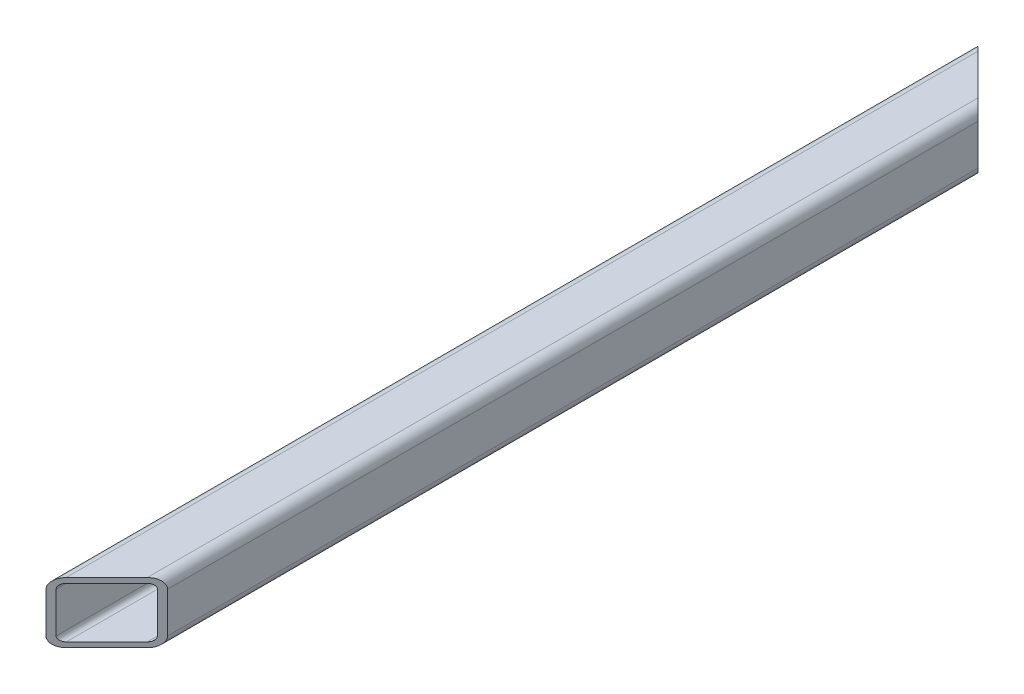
ISO-10303-21;
HEADER;
FILE_DESCRIPTION(('STEP AP214'),'2;1');
FILE_NAME('part.step','',(''),(''),'','','');
FILE_SCHEMA(('AUTOMOTIVE_DESIGN { 1 0 10303 214 1 1 1 1 }'));
ENDSEC;
DATA;
#1=APPLICATION_CONTEXT('core data for automotive mechanical design processes');
#2=APPLICATION_PROTOCOL_DEFINITION('international standard','automotive_design',2000,#1);
#3=PRODUCT_CONTEXT('',#1,'mechanical');
#4=PRODUCT('Part','Part','',(#3));
#5=PRODUCT_RELATED_PRODUCT_CATEGORY('part','',(#4));
#6=PRODUCT_DEFINITION_FORMATION('','',#4);
#7=PRODUCT_DEFINITION_CONTEXT('part definition',#1,'design');
#8=PRODUCT_DEFINITION('design','',#6,#7);
#9=PRODUCT_DEFINITION_SHAPE('','',#8);
#10=(LENGTH_UNIT() NAMED_UNIT(*) SI_UNIT(.MILLI.,.METRE.));
#11=(NAMED_UNIT(*) PLANE_ANGLE_UNIT() SI_UNIT($,.RADIAN.));
#12=(NAMED_UNIT(*) SI_UNIT($,.STERADIAN.) SOLID_ANGLE_UNIT());
#13=UNCERTAINTY_MEASURE_WITH_UNIT(LENGTH_MEASURE(1.E-05),#10,'distance_accuracy_value','');
#14=(GEOMETRIC_REPRESENTATION_CONTEXT(3) GLOBAL_UNCERTAINTY_ASSIGNED_CONTEXT((#13)) GLOBAL_UNIT_ASSIGNED_CONTEXT((#10,
#11,#12)) REPRESENTATION_CONTEXT('',''));
#15=CARTESIAN_POINT('',(0.,0.,0.));
#16=DIRECTION('',(0.,0.,1.));
#17=DIRECTION('',(1.,0.,0.));
#18=AXIS2_PLACEMENT_3D('',#15,#16,#17);
#19=CARTESIAN_POINT('',(20.,20.,920.));
#20=DIRECTION('',(0.,0.,-1.));
#21=DIRECTION('',(-1.,0.,0.));
#22=AXIS2_PLACEMENT_3D('',#19,#20,#21);
#23=CYLINDRICAL_SURFACE('',#22,10.);
#24=DIRECTION('',(0.,0.,-1.));
#25=VECTOR('',#24,1.);
#26=CARTESIAN_POINT('',(30.,20.,920.));
#27=LINE('',#26,#25);
#28=CARTESIAN_POINT('',(30.,20.,860.));
#29=VERTEX_POINT('',#28);
#30=CARTESIAN_POINT('',(30.,20.,59.9999999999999));
#31=VERTEX_POINT('',#30);
#32=EDGE_CURVE('E220',#29,#31,#27,.T.);
#33=ORIENTED_EDGE('',*,*,#32,.T.);
#34=CARTESIAN_POINT('',(20.,20.,50.));
#35=DIRECTION('',(-0.707106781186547,0.,0.707106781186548));
#36=DIRECTION('',(-0.707106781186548,0.,-0.707106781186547));
#37=AXIS2_PLACEMENT_3D('',#34,#35,#36);
#38=ELLIPSE('',#37,14.1421356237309,10.);
#39=CARTESIAN_POINT('',(19.9999999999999,30.,49.9999999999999));
#40=VERTEX_POINT('',#39);
#41=EDGE_CURVE('E46',#31,#40,#38,.T.);
#42=ORIENTED_EDGE('',*,*,#41,.T.);
#43=DIRECTION('',(0.,0.,-1.));
#44=VECTOR('',#43,1.);
#45=CARTESIAN_POINT('',(20.,30.,920.));
#46=LINE('',#45,#44);
#47=CARTESIAN_POINT('',(20.,30.,870.));
#48=VERTEX_POINT('',#47);
#49=EDGE_CURVE('E160',#48,#40,#46,.T.);
#50=ORIENTED_EDGE('',*,*,#49,.F.);
#51=CARTESIAN_POINT('',(20.,20.,870.));
#52=DIRECTION('',(-0.707106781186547,0.,-0.707106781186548));
#53=DIRECTION('',(0.707106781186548,0.,-0.707106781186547));
#54=AXIS2_PLACEMENT_3D('',#51,#52,#53);
#55=ELLIPSE('',#54,14.1421356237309,10.);
#56=EDGE_CURVE('E200',#48,#29,#55,.T.);
#57=ORIENTED_EDGE('',*,*,#56,.T.);
#58=EDGE_LOOP('',(#33,#42,#50,#57));
#59=FACE_BOUND('',#58,.T.);
#60=ADVANCED_FACE('F32',(#59),#23,.T.);
#61=CARTESIAN_POINT('',(20.,30.,920.));
#62=DIRECTION('',(0.,-1.,0.));
#63=DIRECTION('',(1.,0.,0.));
#64=AXIS2_PLACEMENT_3D('',#61,#62,#63);
#65=PLANE('',#64);
#66=ORIENTED_EDGE('',*,*,#49,.T.);
#67=DIRECTION('',(0.707106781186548,0.,0.707106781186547));
#68=VECTOR('',#67,1.);
#69=CARTESIAN_POINT('',(-30.,30.,0.));
#70=LINE('',#69,#68);
#71=CARTESIAN_POINT('',(-20.,30.,10.));
#72=VERTEX_POINT('',#71);
#73=EDGE_CURVE('E144',#72,#40,#70,.T.);
#74=ORIENTED_EDGE('',*,*,#73,.F.);
#75=DIRECTION('',(0.,0.,-1.));
#76=VECTOR('',#75,1.);
#77=CARTESIAN_POINT('',(-20.,30.,920.));
#78=LINE('',#77,#76);
#79=CARTESIAN_POINT('',(-20.,30.,910.));
#80=VERTEX_POINT('',#79);
#81=EDGE_CURVE('E158',#80,#72,#78,.T.);
#82=ORIENTED_EDGE('',*,*,#81,.F.);
#83=DIRECTION('',(-0.707106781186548,0.,0.707106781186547));
#84=VECTOR('',#83,1.);
#85=CARTESIAN_POINT('',(-30.,30.,920.));
#86=LINE('',#85,#84);
#87=EDGE_CURVE('E244',#48,#80,#86,.T.);
#88=ORIENTED_EDGE('',*,*,#87,.F.);
#89=EDGE_LOOP('',(#66,#74,#82,#88));
#90=FACE_BOUND('',#89,.T.);
#91=ADVANCED_FACE('F156',(#90),#65,.F.);
#92=CARTESIAN_POINT('',(-20.,20.,920.));
#93=DIRECTION('',(0.,0.,-1.));
#94=DIRECTION('',(-1.,0.,0.));
#95=AXIS2_PLACEMENT_3D('',#92,#93,#94);
#96=CYLINDRICAL_SURFACE('',#95,10.);
#97=ORIENTED_EDGE('',*,*,#81,.T.);
#98=CARTESIAN_POINT('',(-20.,20.,10.0000000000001));
#99=DIRECTION('',(-0.707106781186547,0.,0.707106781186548));
#100=DIRECTION('',(-0.707106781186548,0.,-0.707106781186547));
#101=AXIS2_PLACEMENT_3D('',#98,#99,#100);
#102=ELLIPSE('',#101,14.1421356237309,10.);
#103=CARTESIAN_POINT('',(-30.,20.,0.));
#104=VERTEX_POINT('',#103);
#105=EDGE_CURVE('E141',#72,#104,#102,.T.);
#106=ORIENTED_EDGE('',*,*,#105,.T.);
#107=DIRECTION('',(0.,0.,-1.));
#108=VECTOR('',#107,1.);
#109=CARTESIAN_POINT('',(-30.,20.,920.));
#110=LINE('',#109,#108);
#111=CARTESIAN_POINT('',(-30.,20.,920.));
#112=VERTEX_POINT('',#111);
#113=EDGE_CURVE('E166',#112,#104,#110,.T.);
#114=ORIENTED_EDGE('',*,*,#113,.F.);
#115=CARTESIAN_POINT('',(-20.,20.,910.));
#116=DIRECTION('',(-0.707106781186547,0.,-0.707106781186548));
#117=DIRECTION('',(0.707106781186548,0.,-0.707106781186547));
#118=AXIS2_PLACEMENT_3D('',#115,#116,#117);
#119=ELLIPSE('',#118,14.1421356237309,10.);
#120=EDGE_CURVE('E165',#112,#80,#119,.T.);
#121=ORIENTED_EDGE('',*,*,#120,.T.);
#122=EDGE_LOOP('',(#97,#106,#114,#121));
#123=FACE_BOUND('',#122,.T.);
#124=ADVANCED_FACE('F164',(#123),#96,.T.);
#125=CARTESIAN_POINT('',(-30.,-20.,920.));
#126=DIRECTION('',(1.,0.,0.));
#127=DIRECTION('',(0.,1.,0.));
#128=AXIS2_PLACEMENT_3D('',#125,#126,#127);
#129=PLANE('',#128);
#130=DIRECTION('',(0.,-1.,0.));
#131=VECTOR('',#130,1.);
#132=CARTESIAN_POINT('',(-30.,-20.,0.));
#133=LINE('',#132,#131);
#134=CARTESIAN_POINT('',(-30.,-20.,1.26634813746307E-13));
#135=VERTEX_POINT('',#134);
#136=EDGE_CURVE('E146',#104,#135,#133,.T.);
#137=ORIENTED_EDGE('',*,*,#136,.T.);
#138=DIRECTION('',(0.,0.,-1.));
#139=VECTOR('',#138,1.);
#140=CARTESIAN_POINT('',(-30.,-20.,920.));
#141=LINE('',#140,#139);
#142=CARTESIAN_POINT('',(-30.,-20.,920.));
#143=VERTEX_POINT('',#142);
#144=EDGE_CURVE('E169',#143,#135,#141,.T.);
#145=ORIENTED_EDGE('',*,*,#144,.F.);
#146=DIRECTION('',(0.,-1.,0.));
#147=VECTOR('',#146,1.);
#148=CARTESIAN_POINT('',(-30.,-20.,920.));
#149=LINE('',#148,#147);
#150=EDGE_CURVE('E218',#112,#143,#149,.T.);
#151=ORIENTED_EDGE('',*,*,#150,.F.);
#152=ORIENTED_EDGE('',*,*,#113,.T.);
#153=EDGE_LOOP('',(#137,#145,#151,#152));
#154=FACE_BOUND('',#153,.T.);
#155=ADVANCED_FACE('F242',(#154),#129,.F.);
#156=CARTESIAN_POINT('',(-20.,-20.,920.));
#157=DIRECTION('',(0.,0.,-1.));
#158=DIRECTION('',(-1.,0.,0.));
#159=AXIS2_PLACEMENT_3D('',#156,#157,#158);
#160=CYLINDRICAL_SURFACE('',#159,10.);
#161=ORIENTED_EDGE('',*,*,#144,.T.);
#162=CARTESIAN_POINT('',(-20.,-20.,10.0000000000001));
#163=DIRECTION('',(-0.707106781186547,0.,0.707106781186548));
#164=DIRECTION('',(-0.707106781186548,0.,-0.707106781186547));
#165=AXIS2_PLACEMENT_3D('',#162,#163,#164);
#166=ELLIPSE('',#165,14.1421356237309,10.);
#167=CARTESIAN_POINT('',(-20.,-30.,9.99999999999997));
#168=VERTEX_POINT('',#167);
#169=EDGE_CURVE('E151',#135,#168,#166,.T.);
#170=ORIENTED_EDGE('',*,*,#169,.T.);
#171=DIRECTION('',(0.,0.,-1.));
#172=VECTOR('',#171,1.);
#173=CARTESIAN_POINT('',(-20.,-30.,920.));
#174=LINE('',#173,#172);
#175=CARTESIAN_POINT('',(-20.,-30.,910.));
#176=VERTEX_POINT('',#175);
#177=EDGE_CURVE('E230',#176,#168,#174,.T.);
#178=ORIENTED_EDGE('',*,*,#177,.F.);
#179=CARTESIAN_POINT('',(-20.,-20.,910.));
#180=DIRECTION('',(-0.707106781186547,0.,-0.707106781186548));
#181=DIRECTION('',(0.707106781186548,0.,-0.707106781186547));
#182=AXIS2_PLACEMENT_3D('',#179,#180,#181);
#183=ELLIPSE('',#182,14.1421356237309,10.);
#184=EDGE_CURVE('E239',#176,#143,#183,.T.);
#185=ORIENTED_EDGE('',*,*,#184,.T.);
#186=EDGE_LOOP('',(#161,#170,#178,#185));
#187=FACE_BOUND('',#186,.T.);
#188=ADVANCED_FACE('F237',(#187),#160,.T.);
#189=CARTESIAN_POINT('',(-20.,-30.,920.));
#190=DIRECTION('',(0.,1.,0.));
#191=DIRECTION('',(-1.,0.,0.));
#192=AXIS2_PLACEMENT_3D('',#189,#190,#191);
#193=PLANE('',#192);
#194=ORIENTED_EDGE('',*,*,#177,.T.);
#195=DIRECTION('',(0.707106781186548,0.,0.707106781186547));
#196=VECTOR('',#195,1.);
#197=CARTESIAN_POINT('',(-30.,-30.,0.));
#198=LINE('',#197,#196);
#199=CARTESIAN_POINT('',(20.,-30.,50.));
#200=VERTEX_POINT('',#199);
#201=EDGE_CURVE('E161',#168,#200,#198,.T.);
#202=ORIENTED_EDGE('',*,*,#201,.T.);
#203=DIRECTION('',(0.,0.,-1.));
#204=VECTOR('',#203,1.);
#205=CARTESIAN_POINT('',(20.,-30.,920.));
#206=LINE('',#205,#204);
#207=CARTESIAN_POINT('',(20.,-30.,870.));
#208=VERTEX_POINT('',#207);
#209=EDGE_CURVE('E227',#208,#200,#206,.T.);
#210=ORIENTED_EDGE('',*,*,#209,.F.);
#211=DIRECTION('',(-0.707106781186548,0.,0.707106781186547));
#212=VECTOR('',#211,1.);
#213=CARTESIAN_POINT('',(-30.,-30.,920.));
#214=LINE('',#213,#212);
#215=EDGE_CURVE('E263',#208,#176,#214,.T.);
#216=ORIENTED_EDGE('',*,*,#215,.T.);
#217=EDGE_LOOP('',(#194,#202,#210,#216));
#218=FACE_BOUND('',#217,.T.);
#219=ADVANCED_FACE('F289',(#218),#193,.F.);
#220=CARTESIAN_POINT('',(20.,-20.,920.));
#221=DIRECTION('',(0.,0.,-1.));
#222=DIRECTION('',(-1.,0.,0.));
#223=AXIS2_PLACEMENT_3D('',#220,#221,#222);
#224=CYLINDRICAL_SURFACE('',#223,10.);
#225=ORIENTED_EDGE('',*,*,#209,.T.);
#226=CARTESIAN_POINT('',(20.,-20.,50.));
#227=DIRECTION('',(-0.707106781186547,0.,0.707106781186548));
#228=DIRECTION('',(-0.707106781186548,0.,-0.707106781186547));
#229=AXIS2_PLACEMENT_3D('',#226,#227,#228);
#230=ELLIPSE('',#229,14.1421356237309,10.);
#231=CARTESIAN_POINT('',(30.,-20.,60.));
#232=VERTEX_POINT('',#231);
#233=EDGE_CURVE('E268',#200,#232,#230,.T.);
#234=ORIENTED_EDGE('',*,*,#233,.T.);
#235=DIRECTION('',(0.,0.,-1.));
#236=VECTOR('',#235,1.);
#237=CARTESIAN_POINT('',(30.,-20.,920.));
#238=LINE('',#237,#236);
#239=CARTESIAN_POINT('',(30.,-20.,860.));
#240=VERTEX_POINT('',#239);
#241=EDGE_CURVE('E224',#240,#232,#238,.T.);
#242=ORIENTED_EDGE('',*,*,#241,.F.);
#243=CARTESIAN_POINT('',(20.,-20.,870.));
#244=DIRECTION('',(-0.707106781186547,0.,-0.707106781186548));
#245=DIRECTION('',(0.707106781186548,0.,-0.707106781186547));
#246=AXIS2_PLACEMENT_3D('',#243,#244,#245);
#247=ELLIPSE('',#246,14.1421356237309,10.);
#248=EDGE_CURVE('E247',#240,#208,#247,.T.);
#249=ORIENTED_EDGE('',*,*,#248,.T.);
#250=EDGE_LOOP('',(#225,#234,#242,#249));
#251=FACE_BOUND('',#250,.T.);
#252=ADVANCED_FACE('F291',(#251),#224,.T.);
#253=CARTESIAN_POINT('',(30.,20.,920.));
#254=DIRECTION('',(-1.,0.,0.));
#255=DIRECTION('',(0.,0.,1.));
#256=AXIS2_PLACEMENT_3D('',#253,#254,#255);
#257=PLANE('',#256);
#258=ORIENTED_EDGE('',*,*,#241,.T.);
#259=DIRECTION('',(0.,1.,0.));
#260=VECTOR('',#259,1.);
#261=CARTESIAN_POINT('',(30.,-30.,60.));
#262=LINE('',#261,#260);
#263=EDGE_CURVE('E284',#232,#31,#262,.T.);
#264=ORIENTED_EDGE('',*,*,#263,.T.);
#265=ORIENTED_EDGE('',*,*,#32,.F.);
#266=DIRECTION('',(0.,1.,0.));
#267=VECTOR('',#266,1.);
#268=CARTESIAN_POINT('',(30.,-30.,860.));
#269=LINE('',#268,#267);
#270=EDGE_CURVE('E193',#240,#29,#269,.T.);
#271=ORIENTED_EDGE('',*,*,#270,.F.);
#272=EDGE_LOOP('',(#258,#264,#265,#271));
#273=FACE_BOUND('',#272,.T.);
#274=ADVANCED_FACE('F296',(#273),#257,.F.);
#275=CARTESIAN_POINT('',(-20.,20.,920.));
#276=DIRECTION('',(0.,0.,-1.));
#277=DIRECTION('',(-1.,0.,0.));
#278=AXIS2_PLACEMENT_3D('',#275,#276,#277);
#279=CYLINDRICAL_SURFACE('',#278,5.00000000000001);
#280=CARTESIAN_POINT('',(-20.,20.,10.0000000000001));
#281=DIRECTION('',(-0.707106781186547,0.,0.707106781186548));
#282=DIRECTION('',(-0.707106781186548,0.,-0.707106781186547));
#283=AXIS2_PLACEMENT_3D('',#280,#281,#282);
#284=ELLIPSE('',#283,7.07106781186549,5.00000000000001);
#285=CARTESIAN_POINT('',(-20.,25.,10.));
#286=VERTEX_POINT('',#285);
#287=CARTESIAN_POINT('',(-25.,20.,5.0000000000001));
#288=VERTEX_POINT('',#287);
#289=EDGE_CURVE('E271',#286,#288,#284,.T.);
#290=ORIENTED_EDGE('',*,*,#289,.F.);
#291=DIRECTION('',(0.,0.,-1.));
#292=VECTOR('',#291,1.);
#293=CARTESIAN_POINT('',(-20.,25.,920.));
#294=LINE('',#293,#292);
#295=CARTESIAN_POINT('',(-20.,25.,910.));
#296=VERTEX_POINT('',#295);
#297=EDGE_CURVE('E196',#296,#286,#294,.T.);
#298=ORIENTED_EDGE('',*,*,#297,.F.);
#299=CARTESIAN_POINT('',(-20.,20.,910.));
#300=DIRECTION('',(-0.707106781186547,0.,-0.707106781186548));
#301=DIRECTION('',(0.707106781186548,0.,-0.707106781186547));
#302=AXIS2_PLACEMENT_3D('',#299,#300,#301);
#303=ELLIPSE('',#302,7.07106781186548,5.00000000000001);
#304=CARTESIAN_POINT('',(-25.,20.,915.));
#305=VERTEX_POINT('',#304);
#306=EDGE_CURVE('E180',#305,#296,#303,.T.);
#307=ORIENTED_EDGE('',*,*,#306,.F.);
#308=DIRECTION('',(0.,0.,-1.));
#309=VECTOR('',#308,1.);
#310=CARTESIAN_POINT('',(-25.,20.,920.));
#311=LINE('',#310,#309);
#312=EDGE_CURVE('E215',#305,#288,#311,.T.);
#313=ORIENTED_EDGE('',*,*,#312,.T.);
#314=EDGE_LOOP('',(#290,#298,#307,#313));
#315=FACE_BOUND('',#314,.T.);
#316=ADVANCED_FACE('F317',(#315),#279,.F.);
#317=CARTESIAN_POINT('',(-25.,-20.,920.));
#318=DIRECTION('',(1.,0.,0.));
#319=DIRECTION('',(0.,1.,0.));
#320=AXIS2_PLACEMENT_3D('',#317,#318,#319);
#321=PLANE('',#320);
#322=DIRECTION('',(0.,-1.,0.));
#323=VECTOR('',#322,1.);
#324=CARTESIAN_POINT('',(-25.,-20.0000000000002,5.00000000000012));
#325=LINE('',#324,#323);
#326=CARTESIAN_POINT('',(-25.,-20.,5.00000000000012));
#327=VERTEX_POINT('',#326);
#328=EDGE_CURVE('E273',#288,#327,#325,.T.);
#329=ORIENTED_EDGE('',*,*,#328,.F.);
#330=ORIENTED_EDGE('',*,*,#312,.F.);
#331=DIRECTION('',(0.,1.,0.));
#332=VECTOR('',#331,1.);
#333=CARTESIAN_POINT('',(-25.,-20.,915.));
#334=LINE('',#333,#332);
#335=CARTESIAN_POINT('',(-25.,-20.,915.));
#336=VERTEX_POINT('',#335);
#337=EDGE_CURVE('E253',#336,#305,#334,.T.);
#338=ORIENTED_EDGE('',*,*,#337,.F.);
#339=DIRECTION('',(0.,0.,-1.));
#340=VECTOR('',#339,1.);
#341=CARTESIAN_POINT('',(-25.,-20.,920.));
#342=LINE('',#341,#340);
#343=EDGE_CURVE('E212',#336,#327,#342,.T.);
#344=ORIENTED_EDGE('',*,*,#343,.T.);
#345=EDGE_LOOP('',(#329,#330,#338,#344));
#346=FACE_BOUND('',#345,.T.);
#347=ADVANCED_FACE('F320',(#346),#321,.T.);
#348=CARTESIAN_POINT('',(-20.,-20.,920.));
#349=DIRECTION('',(0.,0.,-1.));
#350=DIRECTION('',(-1.,0.,0.));
#351=AXIS2_PLACEMENT_3D('',#348,#349,#350);
#352=CYLINDRICAL_SURFACE('',#351,5.);
#353=CARTESIAN_POINT('',(-20.,-20.,10.0000000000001));
#354=DIRECTION('',(-0.707106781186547,0.,0.707106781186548));
#355=DIRECTION('',(-0.707106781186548,0.,-0.707106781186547));
#356=AXIS2_PLACEMENT_3D('',#353,#354,#355);
#357=ELLIPSE('',#356,7.07106781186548,5.);
#358=CARTESIAN_POINT('',(-20.,-25.,9.99999999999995));
#359=VERTEX_POINT('',#358);
#360=EDGE_CURVE('E275',#327,#359,#357,.T.);
#361=ORIENTED_EDGE('',*,*,#360,.F.);
#362=ORIENTED_EDGE('',*,*,#343,.F.);
#363=CARTESIAN_POINT('',(-20.,-20.,910.));
#364=DIRECTION('',(-0.707106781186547,0.,-0.707106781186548));
#365=DIRECTION('',(0.707106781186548,0.,-0.707106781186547));
#366=AXIS2_PLACEMENT_3D('',#363,#364,#365);
#367=ELLIPSE('',#366,7.07106781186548,5.);
#368=CARTESIAN_POINT('',(-20.,-25.,910.));
#369=VERTEX_POINT('',#368);
#370=EDGE_CURVE('E255',#369,#336,#367,.T.);
#371=ORIENTED_EDGE('',*,*,#370,.F.);
#372=DIRECTION('',(0.,0.,-1.));
#373=VECTOR('',#372,1.);
#374=CARTESIAN_POINT('',(-20.,-25.,920.));
#375=LINE('',#374,#373);
#376=EDGE_CURVE('E209',#369,#359,#375,.T.);
#377=ORIENTED_EDGE('',*,*,#376,.T.);
#378=EDGE_LOOP('',(#361,#362,#371,#377));
#379=FACE_BOUND('',#378,.T.);
#380=ADVANCED_FACE('F324',(#379),#352,.F.);
#381=CARTESIAN_POINT('',(-20.,-25.,920.));
#382=DIRECTION('',(0.,1.,0.));
#383=DIRECTION('',(-1.,0.,0.));
#384=AXIS2_PLACEMENT_3D('',#381,#382,#383);
#385=PLANE('',#384);
#386=DIRECTION('',(0.707106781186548,0.,0.707106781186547));
#387=VECTOR('',#386,1.);
#388=CARTESIAN_POINT('',(435.,-25.,465.));
#389=LINE('',#388,#387);
#390=CARTESIAN_POINT('',(20.,-25.,50.));
#391=VERTEX_POINT('',#390);
#392=EDGE_CURVE('E277',#359,#391,#389,.T.);
#393=ORIENTED_EDGE('',*,*,#392,.F.);
#394=ORIENTED_EDGE('',*,*,#376,.F.);
#395=DIRECTION('',(-0.707106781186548,0.,0.707106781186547));
#396=VECTOR('',#395,1.);
#397=CARTESIAN_POINT('',(-25.,-25.,915.));
#398=LINE('',#397,#396);
#399=CARTESIAN_POINT('',(20.,-25.,870.));
#400=VERTEX_POINT('',#399);
#401=EDGE_CURVE('E257',#400,#369,#398,.T.);
#402=ORIENTED_EDGE('',*,*,#401,.F.);
#403=DIRECTION('',(0.,0.,-1.));
#404=VECTOR('',#403,1.);
#405=CARTESIAN_POINT('',(20.,-25.,920.));
#406=LINE('',#405,#404);
#407=EDGE_CURVE('E206',#400,#391,#406,.T.);
#408=ORIENTED_EDGE('',*,*,#407,.T.);
#409=EDGE_LOOP('',(#393,#394,#402,#408));
#410=FACE_BOUND('',#409,.T.);
#411=ADVANCED_FACE('F328',(#410),#385,.T.);
#412=CARTESIAN_POINT('',(20.,-20.,920.));
#413=DIRECTION('',(0.,0.,-1.));
#414=DIRECTION('',(-1.,0.,0.));
#415=AXIS2_PLACEMENT_3D('',#412,#413,#414);
#416=CYLINDRICAL_SURFACE('',#415,5.00000000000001);
#417=CARTESIAN_POINT('',(20.,-20.,50.));
#418=DIRECTION('',(-0.707106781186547,0.,0.707106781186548));
#419=DIRECTION('',(-0.707106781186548,0.,-0.707106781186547));
#420=AXIS2_PLACEMENT_3D('',#417,#418,#419);
#421=ELLIPSE('',#420,7.07106781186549,5.00000000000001);
#422=CARTESIAN_POINT('',(25.,-20.,55.0000000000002));
#423=VERTEX_POINT('',#422);
#424=EDGE_CURVE('E279',#391,#423,#421,.T.);
#425=ORIENTED_EDGE('',*,*,#424,.F.);
#426=ORIENTED_EDGE('',*,*,#407,.F.);
#427=CARTESIAN_POINT('',(20.,-20.,870.));
#428=DIRECTION('',(-0.707106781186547,0.,-0.707106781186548));
#429=DIRECTION('',(0.707106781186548,0.,-0.707106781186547));
#430=AXIS2_PLACEMENT_3D('',#427,#428,#429);
#431=ELLIPSE('',#430,7.07106781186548,5.00000000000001);
#432=CARTESIAN_POINT('',(25.,-20.,865.));
#433=VERTEX_POINT('',#432);
#434=EDGE_CURVE('E259',#433,#400,#431,.T.);
#435=ORIENTED_EDGE('',*,*,#434,.F.);
#436=DIRECTION('',(0.,0.,-1.));
#437=VECTOR('',#436,1.);
#438=CARTESIAN_POINT('',(25.,-20.,920.));
#439=LINE('',#438,#437);
#440=EDGE_CURVE('E198',#433,#423,#439,.T.);
#441=ORIENTED_EDGE('',*,*,#440,.T.);
#442=EDGE_LOOP('',(#425,#426,#435,#441));
#443=FACE_BOUND('',#442,.T.);
#444=ADVANCED_FACE('F332',(#443),#416,.F.);
#445=CARTESIAN_POINT('',(25.,20.,920.));
#446=DIRECTION('',(-1.,0.,0.));
#447=DIRECTION('',(0.,0.,1.));
#448=AXIS2_PLACEMENT_3D('',#445,#446,#447);
#449=PLANE('',#448);
#450=DIRECTION('',(0.,1.,0.));
#451=VECTOR('',#450,1.);
#452=CARTESIAN_POINT('',(25.,20.0000000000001,55.0000000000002));
#453=LINE('',#452,#451);
#454=CARTESIAN_POINT('',(25.,20.,55.0000000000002));
#455=VERTEX_POINT('',#454);
#456=EDGE_CURVE('E281',#423,#455,#453,.T.);
#457=ORIENTED_EDGE('',*,*,#456,.F.);
#458=ORIENTED_EDGE('',*,*,#440,.F.);
#459=DIRECTION('',(0.,-1.,0.));
#460=VECTOR('',#459,1.);
#461=CARTESIAN_POINT('',(25.,20.,865.));
#462=LINE('',#461,#460);
#463=CARTESIAN_POINT('',(25.,20.,865.));
#464=VERTEX_POINT('',#463);
#465=EDGE_CURVE('E192',#464,#433,#462,.T.);
#466=ORIENTED_EDGE('',*,*,#465,.F.);
#467=DIRECTION('',(0.,0.,-1.));
#468=VECTOR('',#467,1.);
#469=CARTESIAN_POINT('',(25.,20.,920.));
#470=LINE('',#469,#468);
#471=EDGE_CURVE('E191',#464,#455,#470,.T.);
#472=ORIENTED_EDGE('',*,*,#471,.T.);
#473=EDGE_LOOP('',(#457,#458,#466,#472));
#474=FACE_BOUND('',#473,.T.);
#475=ADVANCED_FACE('F336',(#474),#449,.T.);
#476=CARTESIAN_POINT('',(20.,20.,920.));
#477=DIRECTION('',(0.,0.,-1.));
#478=DIRECTION('',(-1.,0.,0.));
#479=AXIS2_PLACEMENT_3D('',#476,#477,#478);
#480=CYLINDRICAL_SURFACE('',#479,5.00000000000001);
#481=CARTESIAN_POINT('',(20.,20.,50.));
#482=DIRECTION('',(-0.707106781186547,0.,0.707106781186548));
#483=DIRECTION('',(-0.707106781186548,0.,-0.707106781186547));
#484=AXIS2_PLACEMENT_3D('',#481,#482,#483);
#485=ELLIPSE('',#484,7.07106781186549,5.00000000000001);
#486=CARTESIAN_POINT('',(20.,25.,50.));
#487=VERTEX_POINT('',#486);
#488=EDGE_CURVE('E53',#455,#487,#485,.T.);
#489=ORIENTED_EDGE('',*,*,#488,.F.);
#490=ORIENTED_EDGE('',*,*,#471,.F.);
#491=CARTESIAN_POINT('',(20.,20.,870.));
#492=DIRECTION('',(-0.707106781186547,0.,-0.707106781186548));
#493=DIRECTION('',(0.707106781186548,0.,-0.707106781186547));
#494=AXIS2_PLACEMENT_3D('',#491,#492,#493);
#495=ELLIPSE('',#494,7.07106781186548,5.00000000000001);
#496=CARTESIAN_POINT('',(20.,25.,870.));
#497=VERTEX_POINT('',#496);
#498=EDGE_CURVE('E177',#497,#464,#495,.T.);
#499=ORIENTED_EDGE('',*,*,#498,.F.);
#500=DIRECTION('',(0.,0.,-1.));
#501=VECTOR('',#500,1.);
#502=CARTESIAN_POINT('',(20.,25.,920.));
#503=LINE('',#502,#501);
#504=EDGE_CURVE('E189',#497,#487,#503,.T.);
#505=ORIENTED_EDGE('',*,*,#504,.T.);
#506=EDGE_LOOP('',(#489,#490,#499,#505));
#507=FACE_BOUND('',#506,.T.);
#508=ADVANCED_FACE('F188',(#507),#480,.F.);
#509=CARTESIAN_POINT('',(20.,25.,920.));
#510=DIRECTION('',(0.,-1.,0.));
#511=DIRECTION('',(1.,0.,0.));
#512=AXIS2_PLACEMENT_3D('',#509,#510,#511);
#513=PLANE('',#512);
#514=DIRECTION('',(-0.707106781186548,0.,-0.707106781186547));
#515=VECTOR('',#514,1.);
#516=CARTESIAN_POINT('',(455.,25.,485.));
#517=LINE('',#516,#515);
#518=EDGE_CURVE('E11',#487,#286,#517,.T.);
#519=ORIENTED_EDGE('',*,*,#518,.F.);
#520=ORIENTED_EDGE('',*,*,#504,.F.);
#521=DIRECTION('',(0.707106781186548,0.,-0.707106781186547));
#522=VECTOR('',#521,1.);
#523=CARTESIAN_POINT('',(-4.99999999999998,25.,895.));
#524=LINE('',#523,#522);
#525=EDGE_CURVE('E39',#296,#497,#524,.T.);
#526=ORIENTED_EDGE('',*,*,#525,.F.);
#527=ORIENTED_EDGE('',*,*,#297,.T.);
#528=EDGE_LOOP('',(#519,#520,#526,#527));
#529=FACE_BOUND('',#528,.T.);
#530=ADVANCED_FACE('F195',(#529),#513,.T.);
#531=CARTESIAN_POINT('',(-30.,-30.,920.));
#532=DIRECTION('',(-0.707106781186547,0.,-0.707106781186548));
#533=DIRECTION('',(-0.707106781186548,0.,0.707106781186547));
#534=AXIS2_PLACEMENT_3D('',#531,#532,#533);
#535=PLANE('',#534);
#536=ORIENTED_EDGE('',*,*,#306,.T.);
#537=ORIENTED_EDGE('',*,*,#525,.T.);
#538=ORIENTED_EDGE('',*,*,#498,.T.);
#539=ORIENTED_EDGE('',*,*,#465,.T.);
#540=ORIENTED_EDGE('',*,*,#434,.T.);
#541=ORIENTED_EDGE('',*,*,#401,.T.);
#542=ORIENTED_EDGE('',*,*,#370,.T.);
#543=ORIENTED_EDGE('',*,*,#337,.T.);
#544=EDGE_LOOP('',(#536,#537,#538,#539,#540,#541,#542,#543));
#545=FACE_BOUND('',#544,.T.);
#546=ORIENTED_EDGE('',*,*,#87,.T.);
#547=ORIENTED_EDGE('',*,*,#120,.F.);
#548=ORIENTED_EDGE('',*,*,#150,.T.);
#549=ORIENTED_EDGE('',*,*,#184,.F.);
#550=ORIENTED_EDGE('',*,*,#215,.F.);
#551=ORIENTED_EDGE('',*,*,#248,.F.);
#552=ORIENTED_EDGE('',*,*,#270,.T.);
#553=ORIENTED_EDGE('',*,*,#56,.F.);
#554=EDGE_LOOP('',(#546,#547,#548,#549,#550,#551,#552,#553));
#555=FACE_BOUND('',#554,.T.);
#556=ADVANCED_FACE('F175',(#545,#555),#535,.F.);
#557=CARTESIAN_POINT('',(-30.,-30.,0.));
#558=DIRECTION('',(-0.707106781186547,0.,0.707106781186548));
#559=DIRECTION('',(0.707106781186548,0.,0.707106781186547));
#560=AXIS2_PLACEMENT_3D('',#557,#558,#559);
#561=PLANE('',#560);
#562=ORIENTED_EDGE('',*,*,#289,.T.);
#563=ORIENTED_EDGE('',*,*,#328,.T.);
#564=ORIENTED_EDGE('',*,*,#360,.T.);
#565=ORIENTED_EDGE('',*,*,#392,.T.);
#566=ORIENTED_EDGE('',*,*,#424,.T.);
#567=ORIENTED_EDGE('',*,*,#456,.T.);
#568=ORIENTED_EDGE('',*,*,#488,.T.);
#569=ORIENTED_EDGE('',*,*,#518,.T.);
#570=EDGE_LOOP('',(#562,#563,#564,#565,#566,#567,#568,#569));
#571=FACE_BOUND('',#570,.T.);
#572=ORIENTED_EDGE('',*,*,#263,.F.);
#573=ORIENTED_EDGE('',*,*,#233,.F.);
#574=ORIENTED_EDGE('',*,*,#201,.F.);
#575=ORIENTED_EDGE('',*,*,#169,.F.);
#576=ORIENTED_EDGE('',*,*,#136,.F.);
#577=ORIENTED_EDGE('',*,*,#105,.F.);
#578=ORIENTED_EDGE('',*,*,#73,.T.);
#579=ORIENTED_EDGE('',*,*,#41,.F.);
#580=EDGE_LOOP('',(#572,#573,#574,#575,#576,#577,#578,#579));
#581=FACE_BOUND('',#580,.T.);
#582=ADVANCED_FACE('F143',(#571,#581),#561,.F.);
#583=CLOSED_SHELL('',(#60,#91,#124,#155,#188,#219,#252,#274,#316,#347,#380,#411,#444,#475,#508,
#530,#556,#582));
#584=MANIFOLD_SOLID_BREP('B2',#583);
#585=ADVANCED_BREP_SHAPE_REPRESENTATION('',(#18,#584),#14);
#586=SHAPE_DEFINITION_REPRESENTATION(#9,#585);
ENDSEC;
END-ISO-10303-21;
